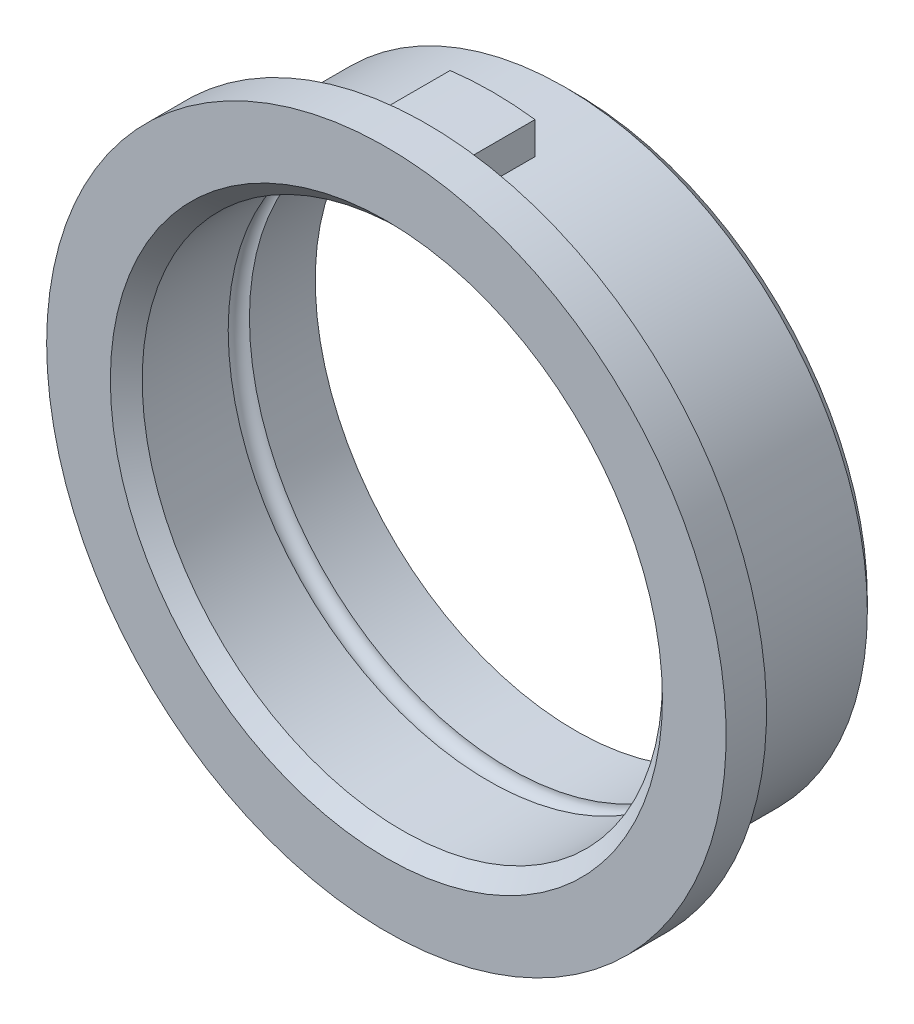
ISO-10303-21;
HEADER;
FILE_DESCRIPTION(('STEP AP214'),'2;1');
FILE_NAME('part.step','',(''),(''),'','','');
FILE_SCHEMA(('AUTOMOTIVE_DESIGN { 1 0 10303 214 1 1 1 1 }'));
ENDSEC;
DATA;
#1=APPLICATION_CONTEXT('core data for automotive mechanical design processes');
#2=APPLICATION_PROTOCOL_DEFINITION('international standard','automotive_design',2000,#1);
#3=PRODUCT_CONTEXT('',#1,'mechanical');
#4=PRODUCT('Part','Part','',(#3));
#5=PRODUCT_RELATED_PRODUCT_CATEGORY('part','',(#4));
#6=PRODUCT_DEFINITION_FORMATION('','',#4);
#7=PRODUCT_DEFINITION_CONTEXT('part definition',#1,'design');
#8=PRODUCT_DEFINITION('design','',#6,#7);
#9=PRODUCT_DEFINITION_SHAPE('','',#8);
#10=(LENGTH_UNIT() NAMED_UNIT(*) SI_UNIT(.MILLI.,.METRE.));
#11=(NAMED_UNIT(*) PLANE_ANGLE_UNIT() SI_UNIT($,.RADIAN.));
#12=(NAMED_UNIT(*) SI_UNIT($,.STERADIAN.) SOLID_ANGLE_UNIT());
#13=UNCERTAINTY_MEASURE_WITH_UNIT(LENGTH_MEASURE(1.E-05),#10,'distance_accuracy_value','');
#14=(GEOMETRIC_REPRESENTATION_CONTEXT(3) GLOBAL_UNCERTAINTY_ASSIGNED_CONTEXT((#13)) GLOBAL_UNIT_ASSIGNED_CONTEXT((#10,
#11,#12)) REPRESENTATION_CONTEXT('',''));
#15=CARTESIAN_POINT('',(0.,0.,0.));
#16=DIRECTION('',(0.,0.,1.));
#17=DIRECTION('',(1.,0.,0.));
#18=AXIS2_PLACEMENT_3D('',#15,#16,#17);
#19=CARTESIAN_POINT('',(0.,-31.75,-7.));
#20=DIRECTION('',(0.,0.,1.));
#21=DIRECTION('',(1.,0.,0.));
#22=AXIS2_PLACEMENT_3D('',#19,#20,#21);
#23=CYLINDRICAL_SURFACE('',#22,14.25);
#24=CARTESIAN_POINT('',(0.,-31.75,-6.5));
#25=DIRECTION('',(0.,0.,1.));
#26=DIRECTION('',(1.,0.,0.));
#27=AXIS2_PLACEMENT_3D('',#24,#25,#26);
#28=CIRCLE('',#27,14.25);
#29=CARTESIAN_POINT('',(14.25,-31.75,-6.5));
#30=VERTEX_POINT('',#29);
#31=EDGE_CURVE('E75',#30,#30,#28,.T.);
#32=ORIENTED_EDGE('',*,*,#31,.T.);
#33=EDGE_LOOP('',(#32));
#34=FACE_BOUND('',#33,.T.);
#35=CARTESIAN_POINT('',(0.,-31.75,0.));
#36=DIRECTION('',(0.,0.,1.));
#37=DIRECTION('',(1.,0.,0.));
#38=AXIS2_PLACEMENT_3D('',#35,#36,#37);
#39=CIRCLE('',#38,14.25);
#40=CARTESIAN_POINT('',(-2.,-17.6410489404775,0.));
#41=VERTEX_POINT('',#40);
#42=CARTESIAN_POINT('',(2.,-17.6410489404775,0.));
#43=VERTEX_POINT('',#42);
#44=EDGE_CURVE('E68',#41,#43,#39,.T.);
#45=ORIENTED_EDGE('',*,*,#44,.F.);
#46=DIRECTION('',(0.,0.,1.));
#47=VECTOR('',#46,1.);
#48=CARTESIAN_POINT('',(-2.,-17.6410489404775,-3.1));
#49=LINE('',#48,#47);
#50=CARTESIAN_POINT('',(-2.,-17.6410489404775,-3.1));
#51=VERTEX_POINT('',#50);
#52=EDGE_CURVE('E43',#51,#41,#49,.T.);
#53=ORIENTED_EDGE('',*,*,#52,.F.);
#54=CARTESIAN_POINT('',(0.,-31.75,-3.1));
#55=DIRECTION('',(0.,0.,1.));
#56=DIRECTION('',(-1.,0.,0.));
#57=AXIS2_PLACEMENT_3D('',#54,#55,#56);
#58=CIRCLE('',#57,14.25);
#59=CARTESIAN_POINT('',(2.,-17.6410489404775,-3.1));
#60=VERTEX_POINT('',#59);
#61=EDGE_CURVE('E48',#60,#51,#58,.T.);
#62=ORIENTED_EDGE('',*,*,#61,.F.);
#63=DIRECTION('',(0.,0.,1.));
#64=VECTOR('',#63,1.);
#65=CARTESIAN_POINT('',(2.,-17.6410489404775,-3.1));
#66=LINE('',#65,#64);
#67=EDGE_CURVE('E79',#60,#43,#66,.T.);
#68=ORIENTED_EDGE('',*,*,#67,.T.);
#69=EDGE_LOOP('',(#45,#53,#62,#68));
#70=FACE_BOUND('',#69,.T.);
#71=ADVANCED_FACE('F29',(#34,#70),#23,.T.);
#72=CARTESIAN_POINT('',(0.,-31.75,0.));
#73=DIRECTION('',(0.,0.,1.));
#74=DIRECTION('',(1.,0.,0.));
#75=AXIS2_PLACEMENT_3D('',#72,#73,#74);
#76=PLANE('',#75);
#77=CARTESIAN_POINT('',(0.,-31.75,0.));
#78=DIRECTION('',(0.,0.,1.));
#79=DIRECTION('',(1.,0.,0.));
#80=AXIS2_PLACEMENT_3D('',#77,#78,#79);
#81=CIRCLE('',#80,16.);
#82=CARTESIAN_POINT('',(-16.,-31.75,0.));
#83=VERTEX_POINT('',#82);
#84=EDGE_CURVE('E110',#83,#83,#81,.T.);
#85=ORIENTED_EDGE('',*,*,#84,.F.);
#86=EDGE_LOOP('',(#85));
#87=FACE_BOUND('',#86,.T.);
#88=DIRECTION('',(0.,1.,0.));
#89=VECTOR('',#88,1.);
#90=CARTESIAN_POINT('',(-2.,-16.127500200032,0.));
#91=LINE('',#90,#89);
#92=CARTESIAN_POINT('',(-2.,-16.127500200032,0.));
#93=VERTEX_POINT('',#92);
#94=EDGE_CURVE('E74',#41,#93,#91,.T.);
#95=ORIENTED_EDGE('',*,*,#94,.F.);
#96=ORIENTED_EDGE('',*,*,#44,.T.);
#97=DIRECTION('',(0.,-1.,0.));
#98=VECTOR('',#97,1.);
#99=CARTESIAN_POINT('',(2.,-16.127500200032,0.));
#100=LINE('',#99,#98);
#101=CARTESIAN_POINT('',(2.,-16.127500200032,0.));
#102=VERTEX_POINT('',#101);
#103=EDGE_CURVE('E71',#102,#43,#100,.T.);
#104=ORIENTED_EDGE('',*,*,#103,.F.);
#105=CARTESIAN_POINT('',(0.,-31.75,0.));
#106=DIRECTION('',(0.,0.,-1.));
#107=DIRECTION('',(-1.,0.,0.));
#108=AXIS2_PLACEMENT_3D('',#105,#106,#107);
#109=CIRCLE('',#108,15.75);
#110=EDGE_CURVE('E88',#93,#102,#109,.T.);
#111=ORIENTED_EDGE('',*,*,#110,.F.);
#112=EDGE_LOOP('',(#95,#96,#104,#111));
#113=FACE_BOUND('',#112,.T.);
#114=ADVANCED_FACE('F69',(#87,#113),#76,.F.);
#115=CARTESIAN_POINT('',(0.,-31.75,-7.));
#116=DIRECTION('',(0.,0.,1.));
#117=DIRECTION('',(1.,0.,0.));
#118=AXIS2_PLACEMENT_3D('',#115,#116,#117);
#119=CYLINDRICAL_SURFACE('',#118,12.25);
#120=CARTESIAN_POINT('',(0.,-31.75,-3.9));
#121=DIRECTION('',(0.,0.,-1.));
#122=DIRECTION('',(-1.,0.,0.));
#123=AXIS2_PLACEMENT_3D('',#120,#121,#122);
#124=CIRCLE('',#123,12.25);
#125=CARTESIAN_POINT('',(-12.25,-31.75,-3.9));
#126=VERTEX_POINT('',#125);
#127=EDGE_CURVE('E107',#126,#126,#124,.T.);
#128=ORIENTED_EDGE('',*,*,#127,.F.);
#129=EDGE_LOOP('',(#128));
#130=FACE_BOUND('',#129,.T.);
#131=CARTESIAN_POINT('',(0.,-31.75,-7.));
#132=DIRECTION('',(0.,0.,1.));
#133=DIRECTION('',(1.,0.,0.));
#134=AXIS2_PLACEMENT_3D('',#131,#132,#133);
#135=CIRCLE('',#134,12.25);
#136=CARTESIAN_POINT('',(12.25,-31.75,-7.));
#137=VERTEX_POINT('',#136);
#138=EDGE_CURVE('E76',#137,#137,#135,.T.);
#139=ORIENTED_EDGE('',*,*,#138,.F.);
#140=EDGE_LOOP('',(#139));
#141=FACE_BOUND('',#140,.T.);
#142=ADVANCED_FACE('F149',(#130,#141),#119,.F.);
#143=CARTESIAN_POINT('',(0.,-31.75,-7.));
#144=DIRECTION('',(0.,0.,1.));
#145=DIRECTION('',(1.,0.,0.));
#146=AXIS2_PLACEMENT_3D('',#143,#144,#145);
#147=PLANE('',#146);
#148=CARTESIAN_POINT('',(0.,-31.75,-7.));
#149=DIRECTION('',(0.,0.,1.));
#150=DIRECTION('',(1.,0.,0.));
#151=AXIS2_PLACEMENT_3D('',#148,#149,#150);
#152=CIRCLE('',#151,13.75);
#153=CARTESIAN_POINT('',(13.75,-31.75,-7.));
#154=VERTEX_POINT('',#153);
#155=EDGE_CURVE('E120',#154,#154,#152,.F.);
#156=ORIENTED_EDGE('',*,*,#155,.T.);
#157=EDGE_LOOP('',(#156));
#158=FACE_BOUND('',#157,.T.);
#159=ORIENTED_EDGE('',*,*,#138,.T.);
#160=EDGE_LOOP('',(#159));
#161=FACE_BOUND('',#160,.T.);
#162=ADVANCED_FACE('F157',(#158,#161),#147,.F.);
#163=CARTESIAN_POINT('',(0.,-31.75,-2.9));
#164=DIRECTION('',(0.,0.,-1.));
#165=DIRECTION('',(-1.,0.,0.));
#166=AXIS2_PLACEMENT_3D('',#163,#164,#165);
#167=CIRCLE('',#166,12.25);
#168=CARTESIAN_POINT('',(-12.25,-31.75,-2.9));
#169=VERTEX_POINT('',#168);
#170=EDGE_CURVE('E104',#169,#169,#167,.T.);
#171=ORIENTED_EDGE('',*,*,#170,.T.);
#172=EDGE_LOOP('',(#171));
#173=FACE_BOUND('',#172,.T.);
#174=CARTESIAN_POINT('',(0.,-31.75,1.15));
#175=DIRECTION('',(0.,0.,1.));
#176=DIRECTION('',(1.,0.,0.));
#177=AXIS2_PLACEMENT_3D('',#174,#175,#176);
#178=CIRCLE('',#177,12.25);
#179=CARTESIAN_POINT('',(12.25,-31.75,1.15));
#180=VERTEX_POINT('',#179);
#181=EDGE_CURVE('E36',#180,#180,#178,.T.);
#182=ORIENTED_EDGE('',*,*,#181,.T.);
#183=EDGE_LOOP('',(#182));
#184=FACE_BOUND('',#183,.T.);
#185=ADVANCED_FACE('F125',(#173,#184),#119,.F.);
#186=CARTESIAN_POINT('',(0.,-31.75,1.9));
#187=DIRECTION('',(0.,0.,1.));
#188=DIRECTION('',(1.,0.,0.));
#189=AXIS2_PLACEMENT_3D('',#186,#187,#188);
#190=PLANE('',#189);
#191=CARTESIAN_POINT('',(0.,-31.75,1.9));
#192=DIRECTION('',(0.,0.,1.));
#193=DIRECTION('',(1.,0.,0.));
#194=AXIS2_PLACEMENT_3D('',#191,#192,#193);
#195=CIRCLE('',#194,13.);
#196=CARTESIAN_POINT('',(13.,-31.75,1.9));
#197=VERTEX_POINT('',#196);
#198=EDGE_CURVE('E11',#197,#197,#195,.F.);
#199=ORIENTED_EDGE('',*,*,#198,.T.);
#200=EDGE_LOOP('',(#199));
#201=FACE_BOUND('',#200,.T.);
#202=CARTESIAN_POINT('',(0.,-31.75,1.9));
#203=DIRECTION('',(0.,0.,1.));
#204=DIRECTION('',(1.,0.,0.));
#205=AXIS2_PLACEMENT_3D('',#202,#203,#204);
#206=CIRCLE('',#205,16.);
#207=CARTESIAN_POINT('',(-16.,-31.75,1.9));
#208=VERTEX_POINT('',#207);
#209=EDGE_CURVE('E113',#208,#208,#206,.T.);
#210=ORIENTED_EDGE('',*,*,#209,.T.);
#211=EDGE_LOOP('',(#210));
#212=FACE_BOUND('',#211,.T.);
#213=ADVANCED_FACE('F162',(#201,#212),#190,.T.);
#214=CARTESIAN_POINT('',(0.,-31.75,1.9));
#215=DIRECTION('',(0.,0.,-1.));
#216=DIRECTION('',(-1.,0.,0.));
#217=AXIS2_PLACEMENT_3D('',#214,#215,#216);
#218=CYLINDRICAL_SURFACE('',#217,16.);
#219=CARTESIAN_POINT('',(-16.,-31.75,1.9));
#220=CARTESIAN_POINT('',(-16.,-31.75,1.88020833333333));
#221=CARTESIAN_POINT('',(-16.,-31.75,1.86041666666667));
#222=CARTESIAN_POINT('',(-16.,-31.75,1.82083333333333));
#223=CARTESIAN_POINT('',(-16.,-31.75,1.80104166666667));
#224=CARTESIAN_POINT('',(-16.,-31.75,1.76145833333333));
#225=CARTESIAN_POINT('',(-16.,-31.75,1.74166666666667));
#226=CARTESIAN_POINT('',(-16.,-31.75,1.70208333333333));
#227=CARTESIAN_POINT('',(-16.,-31.75,1.68229166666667));
#228=CARTESIAN_POINT('',(-16.,-31.75,1.64270833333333));
#229=CARTESIAN_POINT('',(-16.,-31.75,1.62291666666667));
#230=CARTESIAN_POINT('',(-16.,-31.75,1.58333333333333));
#231=CARTESIAN_POINT('',(-16.,-31.75,1.56354166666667));
#232=CARTESIAN_POINT('',(-16.,-31.75,1.52395833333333));
#233=CARTESIAN_POINT('',(-16.,-31.75,1.50416666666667));
#234=CARTESIAN_POINT('',(-16.,-31.75,1.46458333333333));
#235=CARTESIAN_POINT('',(-16.,-31.75,1.44479166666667));
#236=CARTESIAN_POINT('',(-16.,-31.75,1.40520833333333));
#237=CARTESIAN_POINT('',(-16.,-31.75,1.38541666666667));
#238=CARTESIAN_POINT('',(-16.,-31.75,1.34583333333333));
#239=CARTESIAN_POINT('',(-16.,-31.75,1.32604166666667));
#240=CARTESIAN_POINT('',(-16.,-31.75,1.28645833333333));
#241=CARTESIAN_POINT('',(-16.,-31.75,1.26666666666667));
#242=CARTESIAN_POINT('',(-16.,-31.75,1.22708333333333));
#243=CARTESIAN_POINT('',(-16.,-31.75,1.20729166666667));
#244=CARTESIAN_POINT('',(-16.,-31.75,1.16770833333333));
#245=CARTESIAN_POINT('',(-16.,-31.75,1.14791666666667));
#246=CARTESIAN_POINT('',(-16.,-31.75,1.10833333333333));
#247=CARTESIAN_POINT('',(-16.,-31.75,1.08854166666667));
#248=CARTESIAN_POINT('',(-16.,-31.75,1.04895833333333));
#249=CARTESIAN_POINT('',(-16.,-31.75,1.02916666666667));
#250=CARTESIAN_POINT('',(-16.,-31.75,0.989583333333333));
#251=CARTESIAN_POINT('',(-16.,-31.75,0.969791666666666));
#252=CARTESIAN_POINT('',(-16.,-31.75,0.930208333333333));
#253=CARTESIAN_POINT('',(-16.,-31.75,0.910416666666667));
#254=CARTESIAN_POINT('',(-16.,-31.75,0.870833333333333));
#255=CARTESIAN_POINT('',(-16.,-31.75,0.851041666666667));
#256=CARTESIAN_POINT('',(-16.,-31.75,0.811458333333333));
#257=CARTESIAN_POINT('',(-16.,-31.75,0.791666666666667));
#258=CARTESIAN_POINT('',(-16.,-31.75,0.752083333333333));
#259=CARTESIAN_POINT('',(-16.,-31.75,0.732291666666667));
#260=CARTESIAN_POINT('',(-16.,-31.75,0.692708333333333));
#261=CARTESIAN_POINT('',(-16.,-31.75,0.672916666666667));
#262=CARTESIAN_POINT('',(-16.,-31.75,0.633333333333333));
#263=CARTESIAN_POINT('',(-16.,-31.75,0.613541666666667));
#264=CARTESIAN_POINT('',(-16.,-31.75,0.573958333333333));
#265=CARTESIAN_POINT('',(-16.,-31.75,0.554166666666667));
#266=CARTESIAN_POINT('',(-16.,-31.75,0.514583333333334));
#267=CARTESIAN_POINT('',(-16.,-31.75,0.494791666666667));
#268=CARTESIAN_POINT('',(-16.,-31.75,0.455208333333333));
#269=CARTESIAN_POINT('',(-16.,-31.75,0.435416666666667));
#270=CARTESIAN_POINT('',(-16.,-31.75,0.395833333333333));
#271=CARTESIAN_POINT('',(-16.,-31.75,0.376041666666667));
#272=CARTESIAN_POINT('',(-16.,-31.75,0.336458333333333));
#273=CARTESIAN_POINT('',(-16.,-31.75,0.316666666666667));
#274=CARTESIAN_POINT('',(-16.,-31.75,0.277083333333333));
#275=CARTESIAN_POINT('',(-16.,-31.75,0.257291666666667));
#276=CARTESIAN_POINT('',(-16.,-31.75,0.217708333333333));
#277=CARTESIAN_POINT('',(-16.,-31.75,0.197916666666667));
#278=CARTESIAN_POINT('',(-16.,-31.75,0.158333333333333));
#279=CARTESIAN_POINT('',(-16.,-31.75,0.138541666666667));
#280=CARTESIAN_POINT('',(-16.,-31.75,0.0989583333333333));
#281=CARTESIAN_POINT('',(-16.,-31.75,0.0791666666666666));
#282=CARTESIAN_POINT('',(-16.,-31.75,0.0395833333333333));
#283=CARTESIAN_POINT('',(-16.,-31.75,0.0197916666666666));
#284=CARTESIAN_POINT('',(-16.,-31.75,0.));
#285=B_SPLINE_CURVE_WITH_KNOTS('',3,(#219,#220,#221,#222,#223,#224,#225,#226,#227,#228,#229,
#230,#231,#232,#233,#234,#235,#236,#237,#238,#239,#240,#241,#242,#243,#244,#245,#246,#247,#248,
#249,#250,#251,#252,#253,#254,#255,#256,#257,#258,#259,#260,#261,#262,#263,#264,#265,#266,#267,
#268,#269,#270,#271,#272,#273,#274,#275,#276,#277,#278,#279,#280,#281,#282,#283,#284),
.UNSPECIFIED.,.F.,.F.,(4,2,2,2,2,2,2,2,2,2,2,2,2,2,2,2,2,2,2,2,2,2,2,2,2,2,2,2,2,2,2,2,4),(0.,
0.0593750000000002,0.11875,0.178125,0.2375,0.296875,0.35625,0.415625,0.475,0.534375,0.59375,
0.653125,0.7125,0.771875,0.83125,0.890625,0.95,1.009375,1.06875,1.128125,1.1875,1.246875,
1.30625,1.365625,1.425,1.484375,1.54375,1.603125,1.6625,1.721875,1.78125,1.840625,1.9),.UNSPECIFIED.);
#286=EDGE_CURVE('BSEAM140',#208,#83,#285,.T.);
#287=ORIENTED_EDGE('',*,*,#209,.F.);
#288=ORIENTED_EDGE('',*,*,#84,.T.);
#289=ORIENTED_EDGE('',*,*,#286,.T.);
#290=ORIENTED_EDGE('',*,*,#286,.F.);
#291=EDGE_LOOP('',(#287,#289,#288,#290));
#292=FACE_BOUND('',#291,.T.);
#293=ADVANCED_FACE('F140',(#292),#218,.T.);
#294=CARTESIAN_POINT('',(0.,-31.75,-6.5));
#295=DIRECTION('',(0.,0.,1.));
#296=DIRECTION('',(1.,0.,0.));
#297=AXIS2_PLACEMENT_3D('',#294,#295,#296);
#298=CONICAL_SURFACE('',#297,14.25,0.785398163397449);
#299=ORIENTED_EDGE('',*,*,#155,.F.);
#300=EDGE_LOOP('',(#299));
#301=FACE_BOUND('',#300,.T.);
#302=ORIENTED_EDGE('',*,*,#31,.F.);
#303=EDGE_LOOP('',(#302));
#304=FACE_BOUND('',#303,.T.);
#305=ADVANCED_FACE('F130',(#301,#304),#298,.T.);
#306=CARTESIAN_POINT('',(0.,-31.75,1.15));
#307=DIRECTION('',(0.,0.,1.));
#308=DIRECTION('',(1.,0.,0.));
#309=AXIS2_PLACEMENT_3D('',#306,#307,#308);
#310=CONICAL_SURFACE('',#309,12.25,0.785398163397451);
#311=ORIENTED_EDGE('',*,*,#198,.F.);
#312=EDGE_LOOP('',(#311));
#313=FACE_BOUND('',#312,.T.);
#314=ORIENTED_EDGE('',*,*,#181,.F.);
#315=EDGE_LOOP('',(#314));
#316=FACE_BOUND('',#315,.T.);
#317=ADVANCED_FACE('F127',(#313,#316),#310,.F.);
#318=CARTESIAN_POINT('',(0.,-31.75,-3.4));
#319=DIRECTION('',(0.,0.,-1.));
#320=DIRECTION('',(-1.,0.,0.));
#321=AXIS2_PLACEMENT_3D('',#318,#319,#320);
#322=TOROIDAL_SURFACE('',#321,12.25,0.5);
#323=ORIENTED_EDGE('',*,*,#170,.F.);
#324=EDGE_LOOP('',(#323));
#325=FACE_BOUND('',#324,.T.);
#326=ORIENTED_EDGE('',*,*,#127,.T.);
#327=EDGE_LOOP('',(#326));
#328=FACE_BOUND('',#327,.T.);
#329=ADVANCED_FACE('F129',(#325,#328),#322,.F.);
#330=CARTESIAN_POINT('',(-2.,-16.127500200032,-3.1));
#331=DIRECTION('',(1.,0.,0.));
#332=DIRECTION('',(0.,1.,0.));
#333=AXIS2_PLACEMENT_3D('',#330,#331,#332);
#334=PLANE('',#333);
#335=ORIENTED_EDGE('',*,*,#94,.T.);
#336=DIRECTION('',(0.,0.,1.));
#337=VECTOR('',#336,1.);
#338=CARTESIAN_POINT('',(-2.,-16.127500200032,-3.1));
#339=LINE('',#338,#337);
#340=CARTESIAN_POINT('',(-2.,-16.127500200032,-3.1));
#341=VERTEX_POINT('',#340);
#342=EDGE_CURVE('E100',#341,#93,#339,.T.);
#343=ORIENTED_EDGE('',*,*,#342,.F.);
#344=DIRECTION('',(0.,1.,0.));
#345=VECTOR('',#344,1.);
#346=CARTESIAN_POINT('',(-2.,-16.127500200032,-3.1));
#347=LINE('',#346,#345);
#348=EDGE_CURVE('E90',#51,#341,#347,.T.);
#349=ORIENTED_EDGE('',*,*,#348,.F.);
#350=ORIENTED_EDGE('',*,*,#52,.T.);
#351=EDGE_LOOP('',(#335,#343,#349,#350));
#352=FACE_BOUND('',#351,.T.);
#353=ADVANCED_FACE('F137',(#352),#334,.F.);
#354=CARTESIAN_POINT('',(0.,-31.75,-3.1));
#355=DIRECTION('',(0.,0.,1.));
#356=DIRECTION('',(1.,0.,0.));
#357=AXIS2_PLACEMENT_3D('',#354,#355,#356);
#358=CYLINDRICAL_SURFACE('',#357,15.75);
#359=ORIENTED_EDGE('',*,*,#110,.T.);
#360=DIRECTION('',(0.,0.,1.));
#361=VECTOR('',#360,1.);
#362=CARTESIAN_POINT('',(2.,-16.127500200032,-3.1));
#363=LINE('',#362,#361);
#364=CARTESIAN_POINT('',(2.,-16.127500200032,-3.1));
#365=VERTEX_POINT('',#364);
#366=EDGE_CURVE('E82',#365,#102,#363,.T.);
#367=ORIENTED_EDGE('',*,*,#366,.F.);
#368=CARTESIAN_POINT('',(0.,-31.75,-3.1));
#369=DIRECTION('',(0.,0.,-1.));
#370=DIRECTION('',(-1.,0.,0.));
#371=AXIS2_PLACEMENT_3D('',#368,#369,#370);
#372=CIRCLE('',#371,15.75);
#373=EDGE_CURVE('E96',#341,#365,#372,.T.);
#374=ORIENTED_EDGE('',*,*,#373,.F.);
#375=ORIENTED_EDGE('',*,*,#342,.T.);
#376=EDGE_LOOP('',(#359,#367,#374,#375));
#377=FACE_BOUND('',#376,.T.);
#378=ADVANCED_FACE('F218',(#377),#358,.T.);
#379=CARTESIAN_POINT('',(2.,-16.127500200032,-3.1));
#380=DIRECTION('',(-1.,0.,0.));
#381=DIRECTION('',(0.,-1.,0.));
#382=AXIS2_PLACEMENT_3D('',#379,#380,#381);
#383=PLANE('',#382);
#384=ORIENTED_EDGE('',*,*,#103,.T.);
#385=ORIENTED_EDGE('',*,*,#67,.F.);
#386=DIRECTION('',(0.,-1.,0.));
#387=VECTOR('',#386,1.);
#388=CARTESIAN_POINT('',(2.,-16.127500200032,-3.1));
#389=LINE('',#388,#387);
#390=EDGE_CURVE('E83',#365,#60,#389,.T.);
#391=ORIENTED_EDGE('',*,*,#390,.F.);
#392=ORIENTED_EDGE('',*,*,#366,.T.);
#393=EDGE_LOOP('',(#384,#385,#391,#392));
#394=FACE_BOUND('',#393,.T.);
#395=ADVANCED_FACE('F86',(#394),#383,.F.);
#396=CARTESIAN_POINT('',(0.,-31.75,-3.1));
#397=DIRECTION('',(0.,0.,-1.));
#398=DIRECTION('',(-1.,0.,0.));
#399=AXIS2_PLACEMENT_3D('',#396,#397,#398);
#400=PLANE('',#399);
#401=ORIENTED_EDGE('',*,*,#61,.T.);
#402=ORIENTED_EDGE('',*,*,#348,.T.);
#403=ORIENTED_EDGE('',*,*,#373,.T.);
#404=ORIENTED_EDGE('',*,*,#390,.T.);
#405=EDGE_LOOP('',(#401,#402,#403,#404));
#406=FACE_BOUND('',#405,.T.);
#407=ADVANCED_FACE('F238',(#406),#400,.T.);
#408=CLOSED_SHELL('',(#71,#114,#142,#162,#185,#213,#293,#305,#317,#329,#353,#378,#395,#407));
#409=MANIFOLD_SOLID_BREP('B2',#408);
#410=ADVANCED_BREP_SHAPE_REPRESENTATION('',(#18,#409),#14);
#411=SHAPE_DEFINITION_REPRESENTATION(#9,#410);
ENDSEC;
END-ISO-10303-21;
